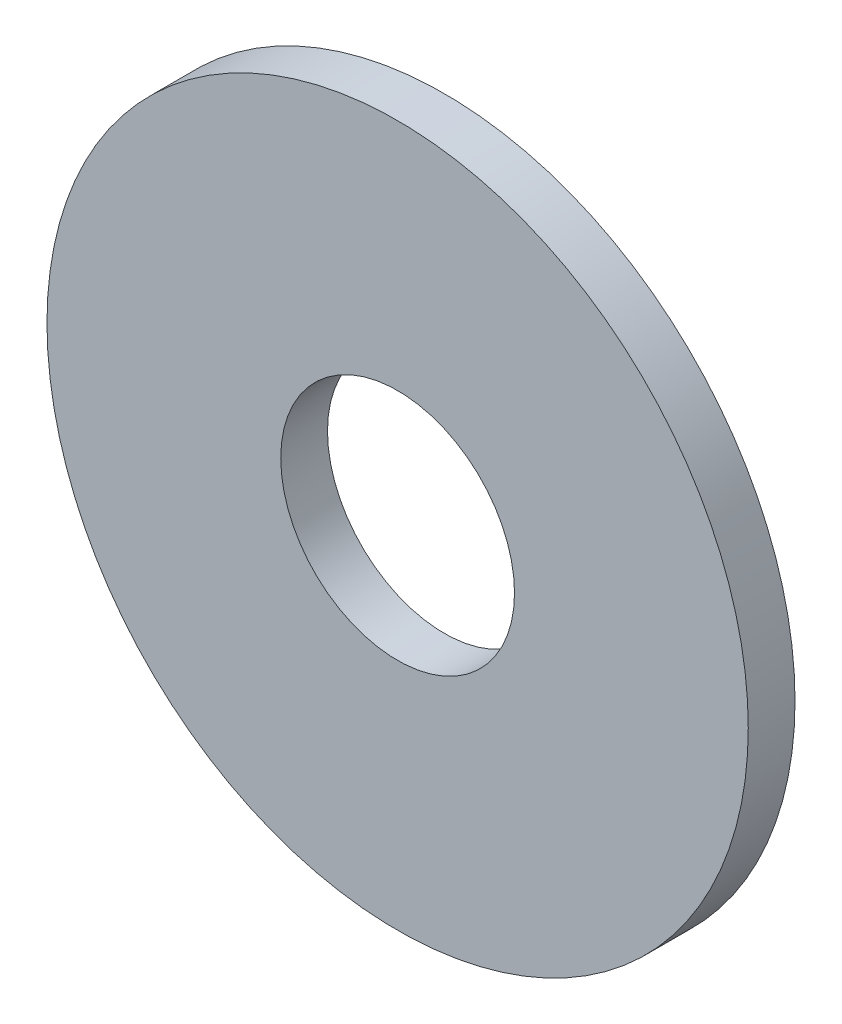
ISO-10303-21;
HEADER;
FILE_DESCRIPTION(('STEP AP214'),'2;1');
FILE_NAME('part.step','',(''),(''),'','','');
FILE_SCHEMA(('AUTOMOTIVE_DESIGN { 1 0 10303 214 1 1 1 1 }'));
ENDSEC;
DATA;
#1=APPLICATION_CONTEXT('core data for automotive mechanical design processes');
#2=APPLICATION_PROTOCOL_DEFINITION('international standard','automotive_design',2000,#1);
#3=PRODUCT_CONTEXT('',#1,'mechanical');
#4=PRODUCT('Part','Part','',(#3));
#5=PRODUCT_RELATED_PRODUCT_CATEGORY('part','',(#4));
#6=PRODUCT_DEFINITION_FORMATION('','',#4);
#7=PRODUCT_DEFINITION_CONTEXT('part definition',#1,'design');
#8=PRODUCT_DEFINITION('design','',#6,#7);
#9=PRODUCT_DEFINITION_SHAPE('','',#8);
#10=(LENGTH_UNIT() NAMED_UNIT(*) SI_UNIT(.MILLI.,.METRE.));
#11=(NAMED_UNIT(*) PLANE_ANGLE_UNIT() SI_UNIT($,.RADIAN.));
#12=(NAMED_UNIT(*) SI_UNIT($,.STERADIAN.) SOLID_ANGLE_UNIT());
#13=UNCERTAINTY_MEASURE_WITH_UNIT(LENGTH_MEASURE(1.E-05),#10,'distance_accuracy_value','');
#14=(GEOMETRIC_REPRESENTATION_CONTEXT(3) GLOBAL_UNCERTAINTY_ASSIGNED_CONTEXT((#13)) GLOBAL_UNIT_ASSIGNED_CONTEXT((#10,
#11,#12)) REPRESENTATION_CONTEXT('',''));
#15=CARTESIAN_POINT('',(0.,0.,0.));
#16=DIRECTION('',(0.,0.,1.));
#17=DIRECTION('',(1.,0.,0.));
#18=AXIS2_PLACEMENT_3D('',#15,#16,#17);
#19=CARTESIAN_POINT('',(0.,0.,2.));
#20=DIRECTION('',(0.,0.,1.));
#21=DIRECTION('',(1.,0.,0.));
#22=AXIS2_PLACEMENT_3D('',#19,#20,#21);
#23=PLANE('',#22);
#24=CARTESIAN_POINT('',(0.,0.,2.));
#25=DIRECTION('',(0.,0.,1.));
#26=DIRECTION('',(1.,0.,0.));
#27=AXIS2_PLACEMENT_3D('',#24,#25,#26);
#28=CIRCLE('',#27,15.);
#29=CARTESIAN_POINT('',(15.,0.,2.));
#30=VERTEX_POINT('',#29);
#31=EDGE_CURVE('E10',#30,#30,#28,.T.);
#32=ORIENTED_EDGE('',*,*,#31,.T.);
#33=EDGE_LOOP('',(#32));
#34=FACE_BOUND('',#33,.T.);
#35=CARTESIAN_POINT('',(0.,0.,2.));
#36=DIRECTION('',(0.,0.,1.));
#37=DIRECTION('',(1.,0.,0.));
#38=AXIS2_PLACEMENT_3D('',#35,#36,#37);
#39=CIRCLE('',#38,5.);
#40=CARTESIAN_POINT('',(5.,0.,2.));
#41=VERTEX_POINT('',#40);
#42=EDGE_CURVE('E40',#41,#41,#39,.T.);
#43=ORIENTED_EDGE('',*,*,#42,.F.);
#44=EDGE_LOOP('',(#43));
#45=FACE_BOUND('',#44,.T.);
#46=ADVANCED_FACE('F29',(#34,#45),#23,.T.);
#47=CARTESIAN_POINT('',(0.,0.,0.));
#48=DIRECTION('',(0.,0.,1.));
#49=DIRECTION('',(1.,0.,0.));
#50=AXIS2_PLACEMENT_3D('',#47,#48,#49);
#51=PLANE('',#50);
#52=CARTESIAN_POINT('',(0.,0.,0.));
#53=DIRECTION('',(0.,0.,1.));
#54=DIRECTION('',(1.,0.,0.));
#55=AXIS2_PLACEMENT_3D('',#52,#53,#54);
#56=CIRCLE('',#55,15.);
#57=CARTESIAN_POINT('',(15.,0.,0.));
#58=VERTEX_POINT('',#57);
#59=EDGE_CURVE('E33',#58,#58,#56,.T.);
#60=ORIENTED_EDGE('',*,*,#59,.F.);
#61=EDGE_LOOP('',(#60));
#62=FACE_BOUND('',#61,.T.);
#63=CARTESIAN_POINT('',(0.,0.,0.));
#64=DIRECTION('',(0.,0.,1.));
#65=DIRECTION('',(1.,0.,0.));
#66=AXIS2_PLACEMENT_3D('',#63,#64,#65);
#67=CIRCLE('',#66,5.);
#68=CARTESIAN_POINT('',(5.,0.,0.));
#69=VERTEX_POINT('',#68);
#70=EDGE_CURVE('E42',#69,#69,#67,.T.);
#71=ORIENTED_EDGE('',*,*,#70,.T.);
#72=EDGE_LOOP('',(#71));
#73=FACE_BOUND('',#72,.T.);
#74=ADVANCED_FACE('F52',(#62,#73),#51,.F.);
#75=CARTESIAN_POINT('',(0.,0.,2.));
#76=DIRECTION('',(0.,0.,-1.));
#77=DIRECTION('',(-1.,0.,0.));
#78=AXIS2_PLACEMENT_3D('',#75,#76,#77);
#79=CYLINDRICAL_SURFACE('',#78,15.);
#80=ORIENTED_EDGE('',*,*,#31,.F.);
#81=EDGE_LOOP('',(#80));
#82=FACE_BOUND('',#81,.T.);
#83=ORIENTED_EDGE('',*,*,#59,.T.);
#84=EDGE_LOOP('',(#83));
#85=FACE_BOUND('',#84,.T.);
#86=ADVANCED_FACE('F31',(#82,#85),#79,.T.);
#87=CARTESIAN_POINT('',(0.,0.,2.));
#88=DIRECTION('',(0.,0.,-1.));
#89=DIRECTION('',(-1.,0.,0.));
#90=AXIS2_PLACEMENT_3D('',#87,#88,#89);
#91=CYLINDRICAL_SURFACE('',#90,5.);
#92=ORIENTED_EDGE('',*,*,#42,.T.);
#93=EDGE_LOOP('',(#92));
#94=FACE_BOUND('',#93,.T.);
#95=ORIENTED_EDGE('',*,*,#70,.F.);
#96=EDGE_LOOP('',(#95));
#97=FACE_BOUND('',#96,.T.);
#98=ADVANCED_FACE('F48',(#94,#97),#91,.F.);
#99=CLOSED_SHELL('',(#46,#74,#86,#98));
#100=MANIFOLD_SOLID_BREP('B2',#99);
#101=ADVANCED_BREP_SHAPE_REPRESENTATION('',(#18,#100),#14);
#102=SHAPE_DEFINITION_REPRESENTATION(#9,#101);
ENDSEC;
END-ISO-10303-21;
